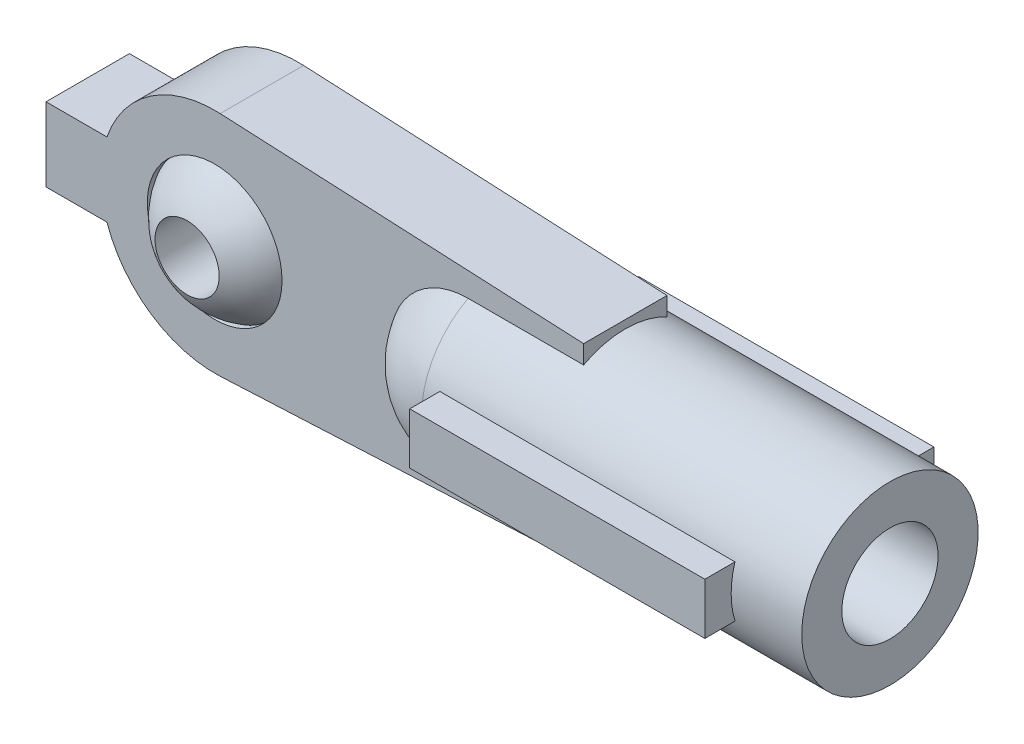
ISO-10303-21;
HEADER;
FILE_DESCRIPTION(('STEP AP214'),'2;1');
FILE_NAME('part.step','',(''),(''),'','','');
FILE_SCHEMA(('AUTOMOTIVE_DESIGN { 1 0 10303 214 1 1 1 1 }'));
ENDSEC;
DATA;
#1=APPLICATION_CONTEXT('core data for automotive mechanical design processes');
#2=APPLICATION_PROTOCOL_DEFINITION('international standard','automotive_design',2000,#1);
#3=PRODUCT_CONTEXT('',#1,'mechanical');
#4=PRODUCT('Part','Part','',(#3));
#5=PRODUCT_RELATED_PRODUCT_CATEGORY('part','',(#4));
#6=PRODUCT_DEFINITION_FORMATION('','',#4);
#7=PRODUCT_DEFINITION_CONTEXT('part definition',#1,'design');
#8=PRODUCT_DEFINITION('design','',#6,#7);
#9=PRODUCT_DEFINITION_SHAPE('','',#8);
#10=(LENGTH_UNIT() NAMED_UNIT(*) SI_UNIT(.MILLI.,.METRE.));
#11=(NAMED_UNIT(*) PLANE_ANGLE_UNIT() SI_UNIT($,.RADIAN.));
#12=(NAMED_UNIT(*) SI_UNIT($,.STERADIAN.) SOLID_ANGLE_UNIT());
#13=UNCERTAINTY_MEASURE_WITH_UNIT(LENGTH_MEASURE(1.E-05),#10,'distance_accuracy_value','');
#14=(GEOMETRIC_REPRESENTATION_CONTEXT(3) GLOBAL_UNCERTAINTY_ASSIGNED_CONTEXT((#13)) GLOBAL_UNIT_ASSIGNED_CONTEXT((#10,
#11,#12)) REPRESENTATION_CONTEXT('',''));
#15=CARTESIAN_POINT('',(0.,0.,0.));
#16=DIRECTION('',(0.,0.,1.));
#17=DIRECTION('',(1.,0.,0.));
#18=AXIS2_PLACEMENT_3D('',#15,#16,#17);
#19=CARTESIAN_POINT('',(0.,0.,0.));
#20=DIRECTION('',(0.,-1.,0.));
#21=DIRECTION('',(-1.,0.,0.));
#22=AXIS2_PLACEMENT_3D('',#19,#20,#21);
#23=SPHERICAL_SURFACE('',#22,2.38);
#24=CARTESIAN_POINT('',(0.,0.,0.));
#25=DIRECTION('',(0.,0.,1.));
#26=DIRECTION('',(1.,0.,0.));
#27=AXIS2_PLACEMENT_3D('',#24,#25,#26);
#28=SPHERICAL_SURFACE('',#27,2.38);
#29=CARTESIAN_POINT('',(0.,0.,-2.1597222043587));
#30=DIRECTION('',(0.,0.,1.));
#31=DIRECTION('',(1.,0.,0.));
#32=AXIS2_PLACEMENT_3D('',#29,#30,#31);
#33=CIRCLE('',#32,1.);
#34=CARTESIAN_POINT('',(1.,0.,-2.1597222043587));
#35=VERTEX_POINT('',#34);
#36=EDGE_CURVE('E11',#35,#35,#33,.F.);
#37=ORIENTED_EDGE('',*,*,#36,.F.);
#38=EDGE_LOOP('',(#37));
#39=FACE_BOUND('',#38,.T.);
#40=CARTESIAN_POINT('',(0.,0.,2.1597222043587));
#41=DIRECTION('',(0.,0.,-1.));
#42=DIRECTION('',(-1.,0.,0.));
#43=AXIS2_PLACEMENT_3D('',#40,#41,#42);
#44=CIRCLE('',#43,1.);
#45=CARTESIAN_POINT('',(-1.,0.,2.1597222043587));
#46=VERTEX_POINT('',#45);
#47=EDGE_CURVE('E56',#46,#46,#44,.F.);
#48=ORIENTED_EDGE('',*,*,#47,.F.);
#49=EDGE_LOOP('',(#48));
#50=FACE_BOUND('',#49,.T.);
#51=ADVANCED_FACE('F50',(#39,#50),#28,.T.);
#52=CARTESIAN_POINT('',(0.,0.,2.75));
#53=DIRECTION('',(0.,0.,-1.));
#54=DIRECTION('',(-1.,0.,0.));
#55=AXIS2_PLACEMENT_3D('',#52,#53,#54);
#56=CYLINDRICAL_SURFACE('',#55,1.);
#57=ORIENTED_EDGE('',*,*,#36,.T.);
#58=EDGE_LOOP('',(#57));
#59=FACE_BOUND('',#58,.T.);
#60=ORIENTED_EDGE('',*,*,#47,.T.);
#61=EDGE_LOOP('',(#60));
#62=FACE_BOUND('',#61,.T.);
#63=ADVANCED_FACE('F62',(#59,#62),#56,.F.);
#64=CLOSED_SHELL('',(#51,#63));
#65=MANIFOLD_SOLID_BREP('B2',#64);
#66=CARTESIAN_POINT('',(0.,0.,0.));
#67=DIRECTION('',(-1.,0.,0.));
#68=DIRECTION('',(0.,0.,1.));
#69=AXIS2_PLACEMENT_3D('',#66,#67,#68);
#70=CYLINDRICAL_SURFACE('',#69,2.75);
#71=CARTESIAN_POINT('',(8.35,0.,0.));
#72=DIRECTION('',(-1.,0.,0.));
#73=DIRECTION('',(0.,0.,-1.));
#74=AXIS2_PLACEMENT_3D('',#71,#72,#73);
#75=CIRCLE('',#74,2.75);
#76=CARTESIAN_POINT('',(8.35,-0.8,2.63106442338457));
#77=VERTEX_POINT('',#76);
#78=CARTESIAN_POINT('',(8.35,0.8,2.63106442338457));
#79=VERTEX_POINT('',#78);
#80=EDGE_CURVE('E272',#77,#79,#75,.T.);
#81=ORIENTED_EDGE('',*,*,#80,.T.);
#82=DIRECTION('',(1.,0.,0.));
#83=VECTOR('',#82,1.);
#84=CARTESIAN_POINT('',(8.35,0.8,2.63106442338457));
#85=LINE('',#84,#83);
#86=CARTESIAN_POINT('',(17.55,0.8,2.63106442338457));
#87=VERTEX_POINT('',#86);
#88=EDGE_CURVE('E288',#79,#87,#85,.T.);
#89=ORIENTED_EDGE('',*,*,#88,.T.);
#90=CARTESIAN_POINT('',(17.55,0.,0.));
#91=DIRECTION('',(-1.,0.,0.));
#92=DIRECTION('',(0.,0.,-1.));
#93=AXIS2_PLACEMENT_3D('',#90,#91,#92);
#94=CIRCLE('',#93,2.75);
#95=CARTESIAN_POINT('',(17.55,-0.8,2.63106442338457));
#96=VERTEX_POINT('',#95);
#97=EDGE_CURVE('E281',#96,#87,#94,.T.);
#98=ORIENTED_EDGE('',*,*,#97,.F.);
#99=DIRECTION('',(1.,0.,0.));
#100=VECTOR('',#99,1.);
#101=CARTESIAN_POINT('',(8.35,-0.8,2.63106442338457));
#102=LINE('',#101,#100);
#103=EDGE_CURVE('E291',#77,#96,#102,.T.);
#104=ORIENTED_EDGE('',*,*,#103,.F.);
#105=EDGE_LOOP('',(#81,#89,#98,#104));
#106=FACE_BOUND('',#105,.T.);
#107=DIRECTION('',(-1.,0.,0.));
#108=VECTOR('',#107,1.);
#109=CARTESIAN_POINT('',(0.,-2.42332416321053,1.3));
#110=LINE('',#109,#108);
#111=CARTESIAN_POINT('',(11.5,-2.42332416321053,1.3));
#112=VERTEX_POINT('',#111);
#113=CARTESIAN_POINT('',(7.9,-2.42332416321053,1.3));
#114=VERTEX_POINT('',#113);
#115=EDGE_CURVE('E315',#112,#114,#110,.T.);
#116=ORIENTED_EDGE('',*,*,#115,.F.);
#117=CARTESIAN_POINT('',(11.5,0.,0.));
#118=DIRECTION('',(-1.,0.,0.));
#119=DIRECTION('',(0.,0.,1.));
#120=AXIS2_PLACEMENT_3D('',#117,#118,#119);
#121=CIRCLE('',#120,2.75);
#122=CARTESIAN_POINT('',(11.5,-2.42332416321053,-1.3));
#123=VERTEX_POINT('',#122);
#124=EDGE_CURVE('E95',#112,#123,#121,.F.);
#125=ORIENTED_EDGE('',*,*,#124,.T.);
#126=DIRECTION('',(-1.,0.,0.));
#127=VECTOR('',#126,1.);
#128=CARTESIAN_POINT('',(0.,-2.42332416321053,-1.3));
#129=LINE('',#128,#127);
#130=CARTESIAN_POINT('',(7.9,-2.42332416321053,-1.3));
#131=VERTEX_POINT('',#130);
#132=EDGE_CURVE('E312',#123,#131,#129,.T.);
#133=ORIENTED_EDGE('',*,*,#132,.T.);
#134=CARTESIAN_POINT('',(7.9,0.,0.));
#135=DIRECTION('',(-1.,0.,0.));
#136=DIRECTION('',(0.,0.,1.));
#137=AXIS2_PLACEMENT_3D('',#134,#135,#136);
#138=CIRCLE('',#137,2.75);
#139=CARTESIAN_POINT('',(7.9,2.42332416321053,-1.3));
#140=VERTEX_POINT('',#139);
#141=EDGE_CURVE('E302',#140,#131,#138,.T.);
#142=ORIENTED_EDGE('',*,*,#141,.F.);
#143=DIRECTION('',(-1.,0.,0.));
#144=VECTOR('',#143,1.);
#145=CARTESIAN_POINT('',(0.,2.42332416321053,-1.3));
#146=LINE('',#145,#144);
#147=CARTESIAN_POINT('',(11.5,2.42332416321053,-1.3));
#148=VERTEX_POINT('',#147);
#149=EDGE_CURVE('E306',#140,#148,#146,.F.);
#150=ORIENTED_EDGE('',*,*,#149,.T.);
#151=CARTESIAN_POINT('',(11.5,2.42332416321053,1.3));
#152=VERTEX_POINT('',#151);
#153=EDGE_CURVE('E386',#148,#152,#121,.F.);
#154=ORIENTED_EDGE('',*,*,#153,.T.);
#155=DIRECTION('',(-1.,0.,0.));
#156=VECTOR('',#155,1.);
#157=CARTESIAN_POINT('',(0.,2.42332416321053,1.3));
#158=LINE('',#157,#156);
#159=CARTESIAN_POINT('',(7.9,2.42332416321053,1.3));
#160=VERTEX_POINT('',#159);
#161=EDGE_CURVE('E309',#160,#152,#158,.F.);
#162=ORIENTED_EDGE('',*,*,#161,.F.);
#163=EDGE_CURVE('E297',#114,#160,#138,.T.);
#164=ORIENTED_EDGE('',*,*,#163,.F.);
#165=EDGE_LOOP('',(#116,#125,#133,#142,#150,#154,#162,#164));
#166=FACE_BOUND('',#165,.T.);
#167=CARTESIAN_POINT('',(19.75,0.,0.));
#168=DIRECTION('',(-1.,0.,0.));
#169=DIRECTION('',(0.,0.,1.));
#170=AXIS2_PLACEMENT_3D('',#167,#168,#169);
#171=CIRCLE('',#170,2.75);
#172=CARTESIAN_POINT('',(19.75,0.,2.75));
#173=VERTEX_POINT('',#172);
#174=EDGE_CURVE('E303',#173,#173,#171,.T.);
#175=ORIENTED_EDGE('',*,*,#174,.T.);
#176=EDGE_LOOP('',(#175));
#177=FACE_BOUND('',#176,.T.);
#178=CARTESIAN_POINT('',(8.35,0.,0.));
#179=DIRECTION('',(-1.,0.,0.));
#180=DIRECTION('',(0.,0.,-1.));
#181=AXIS2_PLACEMENT_3D('',#178,#179,#180);
#182=CIRCLE('',#181,2.75);
#183=CARTESIAN_POINT('',(8.35,0.8,-2.63106442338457));
#184=VERTEX_POINT('',#183);
#185=CARTESIAN_POINT('',(8.35,-0.8,-2.63106442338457));
#186=VERTEX_POINT('',#185);
#187=EDGE_CURVE('E243',#184,#186,#182,.T.);
#188=ORIENTED_EDGE('',*,*,#187,.T.);
#189=DIRECTION('',(1.,0.,0.));
#190=VECTOR('',#189,1.);
#191=CARTESIAN_POINT('',(8.35,-0.8,-2.63106442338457));
#192=LINE('',#191,#190);
#193=CARTESIAN_POINT('',(17.55,-0.8,-2.63106442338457));
#194=VERTEX_POINT('',#193);
#195=EDGE_CURVE('E261',#186,#194,#192,.T.);
#196=ORIENTED_EDGE('',*,*,#195,.T.);
#197=CARTESIAN_POINT('',(17.55,0.,0.));
#198=DIRECTION('',(-1.,0.,0.));
#199=DIRECTION('',(0.,0.,-1.));
#200=AXIS2_PLACEMENT_3D('',#197,#198,#199);
#201=CIRCLE('',#200,2.75);
#202=CARTESIAN_POINT('',(17.55,0.8,-2.63106442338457));
#203=VERTEX_POINT('',#202);
#204=EDGE_CURVE('E250',#203,#194,#201,.T.);
#205=ORIENTED_EDGE('',*,*,#204,.F.);
#206=DIRECTION('',(1.,0.,0.));
#207=VECTOR('',#206,1.);
#208=CARTESIAN_POINT('',(8.35,0.8,-2.63106442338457));
#209=LINE('',#208,#207);
#210=EDGE_CURVE('E233',#184,#203,#209,.T.);
#211=ORIENTED_EDGE('',*,*,#210,.F.);
#212=EDGE_LOOP('',(#188,#196,#205,#211));
#213=FACE_BOUND('',#212,.T.);
#214=ADVANCED_FACE('F87',(#106,#166,#177,#213),#70,.T.);
#215=CARTESIAN_POINT('',(0.,0.,1.3));
#216=DIRECTION('',(0.,0.,1.));
#217=DIRECTION('',(1.,0.,0.));
#218=AXIS2_PLACEMENT_3D('',#215,#216,#217);
#219=PLANE('',#218);
#220=CARTESIAN_POINT('',(0.,0.,1.3));
#221=DIRECTION('',(0.,0.,1.));
#222=DIRECTION('',(1.,0.,0.));
#223=AXIS2_PLACEMENT_3D('',#220,#221,#222);
#224=CIRCLE('',#223,2.1);
#225=CARTESIAN_POINT('',(2.1,0.,1.3));
#226=VERTEX_POINT('',#225);
#227=EDGE_CURVE('E320',#226,#226,#224,.T.);
#228=ORIENTED_EDGE('',*,*,#227,.F.);
#229=EDGE_LOOP('',(#228));
#230=FACE_BOUND('',#229,.T.);
#231=CARTESIAN_POINT('',(7.9,0.,1.3));
#232=DIRECTION('',(0.,0.,1.));
#233=DIRECTION('',(1.,0.,0.));
#234=AXIS2_PLACEMENT_3D('',#231,#232,#233);
#235=CIRCLE('',#234,2.42332416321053);
#236=EDGE_CURVE('E317',#114,#160,#235,.F.);
#237=ORIENTED_EDGE('',*,*,#236,.T.);
#238=ORIENTED_EDGE('',*,*,#161,.T.);
#239=DIRECTION('',(0.,1.,0.));
#240=VECTOR('',#239,1.);
#241=CARTESIAN_POINT('',(11.5,-3.,1.3));
#242=LINE('',#241,#240);
#243=CARTESIAN_POINT('',(11.5,3.,1.3));
#244=VERTEX_POINT('',#243);
#245=EDGE_CURVE('E340',#152,#244,#242,.T.);
#246=ORIENTED_EDGE('',*,*,#245,.T.);
#247=DIRECTION('',(-0.998841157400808,0.0481283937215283,0.));
#248=VECTOR('',#247,1.);
#249=CARTESIAN_POINT('',(11.5,3.,1.3));
#250=LINE('',#249,#248);
#251=CARTESIAN_POINT('',(0.170855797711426,3.54588610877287,1.3));
#252=VERTEX_POINT('',#251);
#253=EDGE_CURVE('E344',#244,#252,#250,.T.);
#254=ORIENTED_EDGE('',*,*,#253,.T.);
#255=CARTESIAN_POINT('',(0.,0.,1.3));
#256=DIRECTION('',(0.,0.,1.));
#257=DIRECTION('',(1.,0.,0.));
#258=AXIS2_PLACEMENT_3D('',#255,#256,#257);
#259=CIRCLE('',#258,3.55);
#260=CARTESIAN_POINT('',(-3.35857112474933,1.15,1.3));
#261=VERTEX_POINT('',#260);
#262=EDGE_CURVE('E326',#252,#261,#259,.T.);
#263=ORIENTED_EDGE('',*,*,#262,.T.);
#264=DIRECTION('',(-1.,0.,0.));
#265=VECTOR('',#264,1.);
#266=CARTESIAN_POINT('',(-3.35857112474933,1.15,1.3));
#267=LINE('',#266,#265);
#268=CARTESIAN_POINT('',(-5.25857112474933,1.15,1.3));
#269=VERTEX_POINT('',#268);
#270=EDGE_CURVE('E329',#261,#269,#267,.T.);
#271=ORIENTED_EDGE('',*,*,#270,.T.);
#272=DIRECTION('',(0.,-1.,0.));
#273=VECTOR('',#272,1.);
#274=CARTESIAN_POINT('',(-5.25857112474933,1.15,1.3));
#275=LINE('',#274,#273);
#276=CARTESIAN_POINT('',(-5.25857112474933,-1.15,1.3));
#277=VERTEX_POINT('',#276);
#278=EDGE_CURVE('E332',#269,#277,#275,.T.);
#279=ORIENTED_EDGE('',*,*,#278,.T.);
#280=DIRECTION('',(1.,0.,0.));
#281=VECTOR('',#280,1.);
#282=CARTESIAN_POINT('',(-5.25857112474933,-1.15,1.3));
#283=LINE('',#282,#281);
#284=CARTESIAN_POINT('',(-3.35857112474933,-1.15,1.3));
#285=VERTEX_POINT('',#284);
#286=EDGE_CURVE('E334',#277,#285,#283,.T.);
#287=ORIENTED_EDGE('',*,*,#286,.T.);
#288=CARTESIAN_POINT('',(0.,0.,1.3));
#289=DIRECTION('',(0.,0.,1.));
#290=DIRECTION('',(1.,0.,0.));
#291=AXIS2_PLACEMENT_3D('',#288,#289,#290);
#292=CIRCLE('',#291,3.55);
#293=CARTESIAN_POINT('',(0.170855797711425,-3.54588610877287,1.3));
#294=VERTEX_POINT('',#293);
#295=EDGE_CURVE('E336',#285,#294,#292,.T.);
#296=ORIENTED_EDGE('',*,*,#295,.T.);
#297=DIRECTION('',(0.998841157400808,0.0481283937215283,0.));
#298=VECTOR('',#297,1.);
#299=CARTESIAN_POINT('',(11.5,-3.,1.3));
#300=LINE('',#299,#298);
#301=CARTESIAN_POINT('',(11.5,-3.,1.3));
#302=VERTEX_POINT('',#301);
#303=EDGE_CURVE('E338',#294,#302,#300,.T.);
#304=ORIENTED_EDGE('',*,*,#303,.T.);
#305=EDGE_CURVE('E341',#302,#112,#242,.T.);
#306=ORIENTED_EDGE('',*,*,#305,.T.);
#307=ORIENTED_EDGE('',*,*,#115,.T.);
#308=EDGE_LOOP('',(#237,#238,#246,#254,#263,#271,#279,#287,#296,#304,#306,#307));
#309=FACE_BOUND('',#308,.T.);
#310=ADVANCED_FACE('F401',(#230,#309),#219,.T.);
#311=CARTESIAN_POINT('',(0.,0.,-1.3));
#312=DIRECTION('',(0.,0.,1.));
#313=DIRECTION('',(1.,0.,0.));
#314=AXIS2_PLACEMENT_3D('',#311,#312,#313);
#315=PLANE('',#314);
#316=CARTESIAN_POINT('',(0.,0.,-1.3));
#317=DIRECTION('',(0.,0.,1.));
#318=DIRECTION('',(1.,0.,0.));
#319=AXIS2_PLACEMENT_3D('',#316,#317,#318);
#320=CIRCLE('',#319,2.1);
#321=CARTESIAN_POINT('',(2.1,0.,-1.3));
#322=VERTEX_POINT('',#321);
#323=EDGE_CURVE('E319',#322,#322,#320,.T.);
#324=ORIENTED_EDGE('',*,*,#323,.T.);
#325=EDGE_LOOP('',(#324));
#326=FACE_BOUND('',#325,.T.);
#327=ORIENTED_EDGE('',*,*,#149,.F.);
#328=CARTESIAN_POINT('',(7.9,0.,-1.3));
#329=DIRECTION('',(0.,0.,1.));
#330=DIRECTION('',(1.,0.,0.));
#331=AXIS2_PLACEMENT_3D('',#328,#329,#330);
#332=CIRCLE('',#331,2.42332416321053);
#333=EDGE_CURVE('E48',#131,#140,#332,.F.);
#334=ORIENTED_EDGE('',*,*,#333,.F.);
#335=ORIENTED_EDGE('',*,*,#132,.F.);
#336=DIRECTION('',(0.,1.,0.));
#337=VECTOR('',#336,1.);
#338=CARTESIAN_POINT('',(11.5,-3.,-1.3));
#339=LINE('',#338,#337);
#340=CARTESIAN_POINT('',(11.5,-3.,-1.3));
#341=VERTEX_POINT('',#340);
#342=EDGE_CURVE('E360',#341,#123,#339,.T.);
#343=ORIENTED_EDGE('',*,*,#342,.F.);
#344=DIRECTION('',(0.998841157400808,0.0481283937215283,0.));
#345=VECTOR('',#344,1.);
#346=CARTESIAN_POINT('',(11.5,-3.,-1.3));
#347=LINE('',#346,#345);
#348=CARTESIAN_POINT('',(0.170855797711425,-3.54588610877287,-1.3));
#349=VERTEX_POINT('',#348);
#350=EDGE_CURVE('E357',#349,#341,#347,.T.);
#351=ORIENTED_EDGE('',*,*,#350,.F.);
#352=CARTESIAN_POINT('',(0.,0.,-1.3));
#353=DIRECTION('',(0.,0.,1.));
#354=DIRECTION('',(1.,0.,0.));
#355=AXIS2_PLACEMENT_3D('',#352,#353,#354);
#356=CIRCLE('',#355,3.55);
#357=CARTESIAN_POINT('',(-3.35857112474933,-1.15,-1.3));
#358=VERTEX_POINT('',#357);
#359=EDGE_CURVE('E355',#358,#349,#356,.T.);
#360=ORIENTED_EDGE('',*,*,#359,.F.);
#361=DIRECTION('',(1.,0.,0.));
#362=VECTOR('',#361,1.);
#363=CARTESIAN_POINT('',(-5.25857112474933,-1.15,-1.3));
#364=LINE('',#363,#362);
#365=CARTESIAN_POINT('',(-5.25857112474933,-1.15,-1.3));
#366=VERTEX_POINT('',#365);
#367=EDGE_CURVE('E353',#366,#358,#364,.T.);
#368=ORIENTED_EDGE('',*,*,#367,.F.);
#369=DIRECTION('',(0.,-1.,0.));
#370=VECTOR('',#369,1.);
#371=CARTESIAN_POINT('',(-5.25857112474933,1.15,-1.3));
#372=LINE('',#371,#370);
#373=CARTESIAN_POINT('',(-5.25857112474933,1.15,-1.3));
#374=VERTEX_POINT('',#373);
#375=EDGE_CURVE('E351',#374,#366,#372,.T.);
#376=ORIENTED_EDGE('',*,*,#375,.F.);
#377=DIRECTION('',(-1.,0.,0.));
#378=VECTOR('',#377,1.);
#379=CARTESIAN_POINT('',(-3.35857112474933,1.15,-1.3));
#380=LINE('',#379,#378);
#381=CARTESIAN_POINT('',(-3.35857112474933,1.15,-1.3));
#382=VERTEX_POINT('',#381);
#383=EDGE_CURVE('E349',#382,#374,#380,.T.);
#384=ORIENTED_EDGE('',*,*,#383,.F.);
#385=CARTESIAN_POINT('',(0.,0.,-1.3));
#386=DIRECTION('',(0.,0.,1.));
#387=DIRECTION('',(1.,0.,0.));
#388=AXIS2_PLACEMENT_3D('',#385,#386,#387);
#389=CIRCLE('',#388,3.55);
#390=CARTESIAN_POINT('',(0.170855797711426,3.54588610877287,-1.3));
#391=VERTEX_POINT('',#390);
#392=EDGE_CURVE('E323',#391,#382,#389,.T.);
#393=ORIENTED_EDGE('',*,*,#392,.F.);
#394=DIRECTION('',(-0.998841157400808,0.0481283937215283,0.));
#395=VECTOR('',#394,1.);
#396=CARTESIAN_POINT('',(11.5,3.,-1.3));
#397=LINE('',#396,#395);
#398=CARTESIAN_POINT('',(11.5,3.,-1.3));
#399=VERTEX_POINT('',#398);
#400=EDGE_CURVE('E330',#399,#391,#397,.T.);
#401=ORIENTED_EDGE('',*,*,#400,.F.);
#402=EDGE_CURVE('E359',#148,#399,#339,.T.);
#403=ORIENTED_EDGE('',*,*,#402,.F.);
#404=EDGE_LOOP('',(#327,#334,#335,#343,#351,#360,#368,#376,#384,#393,#401,#403));
#405=FACE_BOUND('',#404,.T.);
#406=ADVANCED_FACE('F411',(#326,#405),#315,.F.);
#407=CARTESIAN_POINT('',(11.5,-3.,1.3));
#408=DIRECTION('',(-1.,0.,0.));
#409=DIRECTION('',(0.,0.,1.));
#410=AXIS2_PLACEMENT_3D('',#407,#408,#409);
#411=PLANE('',#410);
#412=ORIENTED_EDGE('',*,*,#124,.F.);
#413=ORIENTED_EDGE('',*,*,#305,.F.);
#414=DIRECTION('',(0.,0.,-1.));
#415=VECTOR('',#414,1.);
#416=CARTESIAN_POINT('',(11.5,-3.,1.3));
#417=LINE('',#416,#415);
#418=EDGE_CURVE('E369',#302,#341,#417,.T.);
#419=ORIENTED_EDGE('',*,*,#418,.T.);
#420=ORIENTED_EDGE('',*,*,#342,.T.);
#421=EDGE_LOOP('',(#412,#413,#419,#420));
#422=FACE_BOUND('',#421,.T.);
#423=ADVANCED_FACE('F398',(#422),#411,.F.);
#424=ORIENTED_EDGE('',*,*,#153,.F.);
#425=ORIENTED_EDGE('',*,*,#402,.T.);
#426=DIRECTION('',(0.,0.,-1.));
#427=VECTOR('',#426,1.);
#428=CARTESIAN_POINT('',(11.5,3.,1.3));
#429=LINE('',#428,#427);
#430=EDGE_CURVE('E366',#244,#399,#429,.T.);
#431=ORIENTED_EDGE('',*,*,#430,.F.);
#432=ORIENTED_EDGE('',*,*,#245,.F.);
#433=EDGE_LOOP('',(#424,#425,#431,#432));
#434=FACE_BOUND('',#433,.T.);
#435=ADVANCED_FACE('F451',(#434),#411,.F.);
#436=CARTESIAN_POINT('',(0.,0.,1.3));
#437=DIRECTION('',(0.,0.,-1.));
#438=DIRECTION('',(-1.,0.,0.));
#439=AXIS2_PLACEMENT_3D('',#436,#437,#438);
#440=CYLINDRICAL_SURFACE('',#439,3.55);
#441=ORIENTED_EDGE('',*,*,#392,.T.);
#442=DIRECTION('',(0.,0.,-1.));
#443=VECTOR('',#442,1.);
#444=CARTESIAN_POINT('',(-3.35857112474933,1.15,1.3));
#445=LINE('',#444,#443);
#446=EDGE_CURVE('E384',#261,#382,#445,.T.);
#447=ORIENTED_EDGE('',*,*,#446,.F.);
#448=ORIENTED_EDGE('',*,*,#262,.F.);
#449=DIRECTION('',(0.,0.,-1.));
#450=VECTOR('',#449,1.);
#451=CARTESIAN_POINT('',(0.170855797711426,3.54588610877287,1.3));
#452=LINE('',#451,#450);
#453=EDGE_CURVE('E346',#252,#391,#452,.T.);
#454=ORIENTED_EDGE('',*,*,#453,.T.);
#455=EDGE_LOOP('',(#441,#447,#448,#454));
#456=FACE_BOUND('',#455,.T.);
#457=ADVANCED_FACE('F89',(#456),#440,.T.);
#458=CARTESIAN_POINT('',(-3.35857112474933,1.15,1.3));
#459=DIRECTION('',(0.,-1.,0.));
#460=DIRECTION('',(1.,0.,0.));
#461=AXIS2_PLACEMENT_3D('',#458,#459,#460);
#462=PLANE('',#461);
#463=ORIENTED_EDGE('',*,*,#383,.T.);
#464=DIRECTION('',(0.,0.,-1.));
#465=VECTOR('',#464,1.);
#466=CARTESIAN_POINT('',(-5.25857112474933,1.15,1.3));
#467=LINE('',#466,#465);
#468=EDGE_CURVE('E381',#269,#374,#467,.T.);
#469=ORIENTED_EDGE('',*,*,#468,.F.);
#470=ORIENTED_EDGE('',*,*,#270,.F.);
#471=ORIENTED_EDGE('',*,*,#446,.T.);
#472=EDGE_LOOP('',(#463,#469,#470,#471));
#473=FACE_BOUND('',#472,.T.);
#474=ADVANCED_FACE('F464',(#473),#462,.F.);
#475=CARTESIAN_POINT('',(-5.25857112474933,1.15,1.3));
#476=DIRECTION('',(1.,0.,0.));
#477=DIRECTION('',(0.,0.,-1.));
#478=AXIS2_PLACEMENT_3D('',#475,#476,#477);
#479=PLANE('',#478);
#480=ORIENTED_EDGE('',*,*,#375,.T.);
#481=DIRECTION('',(0.,0.,-1.));
#482=VECTOR('',#481,1.);
#483=CARTESIAN_POINT('',(-5.25857112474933,-1.15,1.3));
#484=LINE('',#483,#482);
#485=EDGE_CURVE('E378',#277,#366,#484,.T.);
#486=ORIENTED_EDGE('',*,*,#485,.F.);
#487=ORIENTED_EDGE('',*,*,#278,.F.);
#488=ORIENTED_EDGE('',*,*,#468,.T.);
#489=EDGE_LOOP('',(#480,#486,#487,#488));
#490=FACE_BOUND('',#489,.T.);
#491=ADVANCED_FACE('F461',(#490),#479,.F.);
#492=CARTESIAN_POINT('',(-5.25857112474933,-1.15,1.3));
#493=DIRECTION('',(0.,1.,0.));
#494=DIRECTION('',(-1.,0.,0.));
#495=AXIS2_PLACEMENT_3D('',#492,#493,#494);
#496=PLANE('',#495);
#497=ORIENTED_EDGE('',*,*,#367,.T.);
#498=DIRECTION('',(0.,0.,-1.));
#499=VECTOR('',#498,1.);
#500=CARTESIAN_POINT('',(-3.35857112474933,-1.15,1.3));
#501=LINE('',#500,#499);
#502=EDGE_CURVE('E375',#285,#358,#501,.T.);
#503=ORIENTED_EDGE('',*,*,#502,.F.);
#504=ORIENTED_EDGE('',*,*,#286,.F.);
#505=ORIENTED_EDGE('',*,*,#485,.T.);
#506=EDGE_LOOP('',(#497,#503,#504,#505));
#507=FACE_BOUND('',#506,.T.);
#508=ADVANCED_FACE('F457',(#507),#496,.F.);
#509=CARTESIAN_POINT('',(0.,0.,1.3));
#510=DIRECTION('',(0.,0.,-1.));
#511=DIRECTION('',(-1.,0.,0.));
#512=AXIS2_PLACEMENT_3D('',#509,#510,#511);
#513=CYLINDRICAL_SURFACE('',#512,3.55);
#514=ORIENTED_EDGE('',*,*,#359,.T.);
#515=DIRECTION('',(0.,0.,-1.));
#516=VECTOR('',#515,1.);
#517=CARTESIAN_POINT('',(0.170855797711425,-3.54588610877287,1.3));
#518=LINE('',#517,#516);
#519=EDGE_CURVE('E372',#294,#349,#518,.T.);
#520=ORIENTED_EDGE('',*,*,#519,.F.);
#521=ORIENTED_EDGE('',*,*,#295,.F.);
#522=ORIENTED_EDGE('',*,*,#502,.T.);
#523=EDGE_LOOP('',(#514,#520,#521,#522));
#524=FACE_BOUND('',#523,.T.);
#525=ADVANCED_FACE('F454',(#524),#513,.T.);
#526=CARTESIAN_POINT('',(11.5,-3.,1.3));
#527=DIRECTION('',(-0.0481283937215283,0.998841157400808,0.));
#528=DIRECTION('',(-0.998841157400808,-0.0481283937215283,0.));
#529=AXIS2_PLACEMENT_3D('',#526,#527,#528);
#530=PLANE('',#529);
#531=ORIENTED_EDGE('',*,*,#350,.T.);
#532=ORIENTED_EDGE('',*,*,#418,.F.);
#533=ORIENTED_EDGE('',*,*,#303,.F.);
#534=ORIENTED_EDGE('',*,*,#519,.T.);
#535=EDGE_LOOP('',(#531,#532,#533,#534));
#536=FACE_BOUND('',#535,.T.);
#537=ADVANCED_FACE('F408',(#536),#530,.F.);
#538=CARTESIAN_POINT('',(11.5,3.,1.3));
#539=DIRECTION('',(-0.0481283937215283,-0.998841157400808,0.));
#540=DIRECTION('',(0.998841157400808,-0.0481283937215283,0.));
#541=AXIS2_PLACEMENT_3D('',#538,#539,#540);
#542=PLANE('',#541);
#543=ORIENTED_EDGE('',*,*,#400,.T.);
#544=ORIENTED_EDGE('',*,*,#453,.F.);
#545=ORIENTED_EDGE('',*,*,#253,.F.);
#546=ORIENTED_EDGE('',*,*,#430,.T.);
#547=EDGE_LOOP('',(#543,#544,#545,#546));
#548=FACE_BOUND('',#547,.T.);
#549=ADVANCED_FACE('F427',(#548),#542,.F.);
#550=CARTESIAN_POINT('',(0.,0.,1.3));
#551=DIRECTION('',(0.,0.,-1.));
#552=DIRECTION('',(-1.,0.,0.));
#553=AXIS2_PLACEMENT_3D('',#550,#551,#552);
#554=CYLINDRICAL_SURFACE('',#553,2.1);
#555=ORIENTED_EDGE('',*,*,#227,.T.);
#556=EDGE_LOOP('',(#555));
#557=FACE_BOUND('',#556,.T.);
#558=ORIENTED_EDGE('',*,*,#323,.F.);
#559=EDGE_LOOP('',(#558));
#560=FACE_BOUND('',#559,.T.);
#561=ADVANCED_FACE('F418',(#557,#560),#554,.F.);
#562=CARTESIAN_POINT('',(7.9,0.,0.));
#563=DIRECTION('',(-1.,0.,0.));
#564=DIRECTION('',(0.,1.,0.));
#565=AXIS2_PLACEMENT_3D('',#562,#563,#564);
#566=SPHERICAL_SURFACE('',#565,2.75);
#567=ORIENTED_EDGE('',*,*,#141,.T.);
#568=ORIENTED_EDGE('',*,*,#333,.T.);
#569=EDGE_LOOP('',(#567,#568));
#570=FACE_BOUND('',#569,.T.);
#571=ADVANCED_FACE('F415',(#570),#566,.T.);
#572=CARTESIAN_POINT('',(19.75,2.75,0.));
#573=DIRECTION('',(-1.,0.,0.));
#574=DIRECTION('',(0.,0.,1.));
#575=AXIS2_PLACEMENT_3D('',#572,#573,#574);
#576=PLANE('',#575);
#577=CARTESIAN_POINT('',(19.75,0.,0.));
#578=DIRECTION('',(1.,0.,0.));
#579=DIRECTION('',(0.,0.,-1.));
#580=AXIS2_PLACEMENT_3D('',#577,#578,#579);
#581=CIRCLE('',#580,1.5);
#582=CARTESIAN_POINT('',(19.75,0.,-1.5));
#583=VERTEX_POINT('',#582);
#584=EDGE_CURVE('E287',#583,#583,#581,.T.);
#585=ORIENTED_EDGE('',*,*,#584,.F.);
#586=EDGE_LOOP('',(#585));
#587=FACE_BOUND('',#586,.T.);
#588=ORIENTED_EDGE('',*,*,#174,.F.);
#589=EDGE_LOOP('',(#588));
#590=FACE_BOUND('',#589,.T.);
#591=ADVANCED_FACE('F417',(#587,#590),#576,.F.);
#592=ORIENTED_EDGE('',*,*,#236,.F.);
#593=ORIENTED_EDGE('',*,*,#163,.T.);
#594=EDGE_LOOP('',(#592,#593));
#595=FACE_BOUND('',#594,.T.);
#596=ADVANCED_FACE('F420',(#595),#566,.T.);
#597=CARTESIAN_POINT('',(8.25,0.,0.));
#598=DIRECTION('',(1.,0.,0.));
#599=DIRECTION('',(0.,0.,-1.));
#600=AXIS2_PLACEMENT_3D('',#597,#598,#599);
#601=CYLINDRICAL_SURFACE('',#600,1.5);
#602=CARTESIAN_POINT('',(8.25,0.,0.));
#603=DIRECTION('',(1.,0.,0.));
#604=DIRECTION('',(0.,0.,-1.));
#605=AXIS2_PLACEMENT_3D('',#602,#603,#604);
#606=CIRCLE('',#605,1.5);
#607=CARTESIAN_POINT('',(8.25,0.,-1.5));
#608=VERTEX_POINT('',#607);
#609=EDGE_CURVE('E294',#608,#608,#606,.T.);
#610=ORIENTED_EDGE('',*,*,#609,.F.);
#611=EDGE_LOOP('',(#610));
#612=FACE_BOUND('',#611,.T.);
#613=ORIENTED_EDGE('',*,*,#584,.T.);
#614=EDGE_LOOP('',(#613));
#615=FACE_BOUND('',#614,.T.);
#616=ADVANCED_FACE('F433',(#612,#615),#601,.F.);
#617=CARTESIAN_POINT('',(8.25,0.,0.));
#618=DIRECTION('',(1.,0.,0.));
#619=DIRECTION('',(0.,0.,-1.));
#620=AXIS2_PLACEMENT_3D('',#617,#618,#619);
#621=PLANE('',#620);
#622=ORIENTED_EDGE('',*,*,#609,.T.);
#623=EDGE_LOOP('',(#622));
#624=FACE_BOUND('',#623,.T.);
#625=ADVANCED_FACE('F578',(#624),#621,.T.);
#626=CARTESIAN_POINT('',(8.35,0.8,3.57));
#627=DIRECTION('',(0.,0.,1.));
#628=DIRECTION('',(0.,-1.,0.));
#629=AXIS2_PLACEMENT_3D('',#626,#627,#628);
#630=PLANE('',#629);
#631=DIRECTION('',(0.,-1.,0.));
#632=VECTOR('',#631,1.);
#633=CARTESIAN_POINT('',(17.55,0.8,3.57));
#634=LINE('',#633,#632);
#635=CARTESIAN_POINT('',(17.55,0.8,3.57));
#636=VERTEX_POINT('',#635);
#637=CARTESIAN_POINT('',(17.55,-0.8,3.57));
#638=VERTEX_POINT('',#637);
#639=EDGE_CURVE('E260',#636,#638,#634,.T.);
#640=ORIENTED_EDGE('',*,*,#639,.F.);
#641=DIRECTION('',(1.,0.,0.));
#642=VECTOR('',#641,1.);
#643=CARTESIAN_POINT('',(8.35,0.8,3.57));
#644=LINE('',#643,#642);
#645=CARTESIAN_POINT('',(8.35,0.8,3.57));
#646=VERTEX_POINT('',#645);
#647=EDGE_CURVE('E285',#646,#636,#644,.T.);
#648=ORIENTED_EDGE('',*,*,#647,.F.);
#649=DIRECTION('',(0.,-1.,0.));
#650=VECTOR('',#649,1.);
#651=CARTESIAN_POINT('',(8.35,0.8,3.57));
#652=LINE('',#651,#650);
#653=CARTESIAN_POINT('',(8.35,-0.8,3.57));
#654=VERTEX_POINT('',#653);
#655=EDGE_CURVE('E265',#646,#654,#652,.T.);
#656=ORIENTED_EDGE('',*,*,#655,.T.);
#657=DIRECTION('',(1.,0.,0.));
#658=VECTOR('',#657,1.);
#659=CARTESIAN_POINT('',(8.35,-0.8,3.57));
#660=LINE('',#659,#658);
#661=EDGE_CURVE('E278',#654,#638,#660,.T.);
#662=ORIENTED_EDGE('',*,*,#661,.T.);
#663=EDGE_LOOP('',(#640,#648,#656,#662));
#664=FACE_BOUND('',#663,.T.);
#665=ADVANCED_FACE('F586',(#664),#630,.T.);
#666=CARTESIAN_POINT('',(8.35,0.8,3.57));
#667=DIRECTION('',(0.,1.,0.));
#668=DIRECTION('',(0.,0.,1.));
#669=AXIS2_PLACEMENT_3D('',#666,#667,#668);
#670=PLANE('',#669);
#671=DIRECTION('',(0.,0.,1.));
#672=VECTOR('',#671,1.);
#673=CARTESIAN_POINT('',(17.55,0.8,3.57));
#674=LINE('',#673,#672);
#675=EDGE_CURVE('E269',#87,#636,#674,.T.);
#676=ORIENTED_EDGE('',*,*,#675,.F.);
#677=ORIENTED_EDGE('',*,*,#88,.F.);
#678=DIRECTION('',(0.,0.,1.));
#679=VECTOR('',#678,1.);
#680=CARTESIAN_POINT('',(8.35,0.8,3.57));
#681=LINE('',#680,#679);
#682=EDGE_CURVE('E275',#79,#646,#681,.T.);
#683=ORIENTED_EDGE('',*,*,#682,.T.);
#684=ORIENTED_EDGE('',*,*,#647,.T.);
#685=EDGE_LOOP('',(#676,#677,#683,#684));
#686=FACE_BOUND('',#685,.T.);
#687=ADVANCED_FACE('F599',(#686),#670,.T.);
#688=CARTESIAN_POINT('',(8.35,-0.8,3.57));
#689=DIRECTION('',(0.,-1.,0.));
#690=DIRECTION('',(0.,0.,-1.));
#691=AXIS2_PLACEMENT_3D('',#688,#689,#690);
#692=PLANE('',#691);
#693=DIRECTION('',(0.,0.,-1.));
#694=VECTOR('',#693,1.);
#695=CARTESIAN_POINT('',(17.55,-0.8,3.57));
#696=LINE('',#695,#694);
#697=EDGE_CURVE('E110',#638,#96,#696,.T.);
#698=ORIENTED_EDGE('',*,*,#697,.F.);
#699=ORIENTED_EDGE('',*,*,#661,.F.);
#700=DIRECTION('',(0.,0.,-1.));
#701=VECTOR('',#700,1.);
#702=CARTESIAN_POINT('',(8.35,-0.8,3.57));
#703=LINE('',#702,#701);
#704=EDGE_CURVE('E268',#654,#77,#703,.T.);
#705=ORIENTED_EDGE('',*,*,#704,.T.);
#706=ORIENTED_EDGE('',*,*,#103,.T.);
#707=EDGE_LOOP('',(#698,#699,#705,#706));
#708=FACE_BOUND('',#707,.T.);
#709=ADVANCED_FACE('F608',(#708),#692,.T.);
#710=CARTESIAN_POINT('',(8.35,0.,0.));
#711=DIRECTION('',(1.,0.,0.));
#712=DIRECTION('',(0.,0.,-1.));
#713=AXIS2_PLACEMENT_3D('',#710,#711,#712);
#714=PLANE('',#713);
#715=ORIENTED_EDGE('',*,*,#655,.F.);
#716=ORIENTED_EDGE('',*,*,#682,.F.);
#717=ORIENTED_EDGE('',*,*,#80,.F.);
#718=ORIENTED_EDGE('',*,*,#704,.F.);
#719=EDGE_LOOP('',(#715,#716,#717,#718));
#720=FACE_BOUND('',#719,.T.);
#721=ADVANCED_FACE('F617',(#720),#714,.F.);
#722=CARTESIAN_POINT('',(17.55,0.,0.));
#723=DIRECTION('',(1.,0.,0.));
#724=DIRECTION('',(0.,0.,-1.));
#725=AXIS2_PLACEMENT_3D('',#722,#723,#724);
#726=PLANE('',#725);
#727=ORIENTED_EDGE('',*,*,#639,.T.);
#728=ORIENTED_EDGE('',*,*,#697,.T.);
#729=ORIENTED_EDGE('',*,*,#97,.T.);
#730=ORIENTED_EDGE('',*,*,#675,.T.);
#731=EDGE_LOOP('',(#727,#728,#729,#730));
#732=FACE_BOUND('',#731,.T.);
#733=ADVANCED_FACE('F626',(#732),#726,.T.);
#734=CARTESIAN_POINT('',(8.35,0.8,-3.57));
#735=DIRECTION('',(0.,0.,-1.));
#736=DIRECTION('',(-1.,0.,0.));
#737=AXIS2_PLACEMENT_3D('',#734,#735,#736);
#738=PLANE('',#737);
#739=DIRECTION('',(0.,1.,0.));
#740=VECTOR('',#739,1.);
#741=CARTESIAN_POINT('',(17.55,0.8,-3.57));
#742=LINE('',#741,#740);
#743=CARTESIAN_POINT('',(17.55,-0.8,-3.57));
#744=VERTEX_POINT('',#743);
#745=CARTESIAN_POINT('',(17.55,0.8,-3.57));
#746=VERTEX_POINT('',#745);
#747=EDGE_CURVE('E255',#744,#746,#742,.T.);
#748=ORIENTED_EDGE('',*,*,#747,.F.);
#749=DIRECTION('',(1.,0.,0.));
#750=VECTOR('',#749,1.);
#751=CARTESIAN_POINT('',(8.35,-0.8,-3.57));
#752=LINE('',#751,#750);
#753=CARTESIAN_POINT('',(8.35,-0.8,-3.57));
#754=VERTEX_POINT('',#753);
#755=EDGE_CURVE('E246',#754,#744,#752,.T.);
#756=ORIENTED_EDGE('',*,*,#755,.F.);
#757=DIRECTION('',(0.,1.,0.));
#758=VECTOR('',#757,1.);
#759=CARTESIAN_POINT('',(8.35,0.8,-3.57));
#760=LINE('',#759,#758);
#761=CARTESIAN_POINT('',(8.35,0.8,-3.57));
#762=VERTEX_POINT('',#761);
#763=EDGE_CURVE('E240',#754,#762,#760,.T.);
#764=ORIENTED_EDGE('',*,*,#763,.T.);
#765=DIRECTION('',(1.,0.,0.));
#766=VECTOR('',#765,1.);
#767=CARTESIAN_POINT('',(8.35,0.8,-3.57));
#768=LINE('',#767,#766);
#769=EDGE_CURVE('E225',#762,#746,#768,.T.);
#770=ORIENTED_EDGE('',*,*,#769,.T.);
#771=EDGE_LOOP('',(#748,#756,#764,#770));
#772=FACE_BOUND('',#771,.T.);
#773=ADVANCED_FACE('F245',(#772),#738,.T.);
#774=CARTESIAN_POINT('',(8.35,-0.8,-2.63106442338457));
#775=DIRECTION('',(0.,-1.,0.));
#776=DIRECTION('',(0.,0.,-1.));
#777=AXIS2_PLACEMENT_3D('',#774,#775,#776);
#778=PLANE('',#777);
#779=DIRECTION('',(0.,0.,-1.));
#780=VECTOR('',#779,1.);
#781=CARTESIAN_POINT('',(17.55,-0.8,-2.63106442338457));
#782=LINE('',#781,#780);
#783=EDGE_CURVE('E247',#194,#744,#782,.T.);
#784=ORIENTED_EDGE('',*,*,#783,.F.);
#785=ORIENTED_EDGE('',*,*,#195,.F.);
#786=DIRECTION('',(0.,0.,-1.));
#787=VECTOR('',#786,1.);
#788=CARTESIAN_POINT('',(8.35,-0.8,-2.63106442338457));
#789=LINE('',#788,#787);
#790=EDGE_CURVE('E234',#186,#754,#789,.T.);
#791=ORIENTED_EDGE('',*,*,#790,.T.);
#792=ORIENTED_EDGE('',*,*,#755,.T.);
#793=EDGE_LOOP('',(#784,#785,#791,#792));
#794=FACE_BOUND('',#793,.T.);
#795=ADVANCED_FACE('F642',(#794),#778,.T.);
#796=CARTESIAN_POINT('',(8.35,0.8,-2.63106442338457));
#797=DIRECTION('',(0.,1.,0.));
#798=DIRECTION('',(0.,0.,1.));
#799=AXIS2_PLACEMENT_3D('',#796,#797,#798);
#800=PLANE('',#799);
#801=DIRECTION('',(0.,0.,1.));
#802=VECTOR('',#801,1.);
#803=CARTESIAN_POINT('',(17.55,0.8,-2.63106442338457));
#804=LINE('',#803,#802);
#805=EDGE_CURVE('E102',#746,#203,#804,.T.);
#806=ORIENTED_EDGE('',*,*,#805,.F.);
#807=ORIENTED_EDGE('',*,*,#769,.F.);
#808=DIRECTION('',(0.,0.,1.));
#809=VECTOR('',#808,1.);
#810=CARTESIAN_POINT('',(8.35,0.8,-2.63106442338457));
#811=LINE('',#810,#809);
#812=EDGE_CURVE('E228',#762,#184,#811,.T.);
#813=ORIENTED_EDGE('',*,*,#812,.T.);
#814=ORIENTED_EDGE('',*,*,#210,.T.);
#815=EDGE_LOOP('',(#806,#807,#813,#814));
#816=FACE_BOUND('',#815,.T.);
#817=ADVANCED_FACE('F227',(#816),#800,.T.);
#818=CARTESIAN_POINT('',(8.35,0.,0.));
#819=DIRECTION('',(1.,0.,0.));
#820=DIRECTION('',(0.,0.,-1.));
#821=AXIS2_PLACEMENT_3D('',#818,#819,#820);
#822=PLANE('',#821);
#823=ORIENTED_EDGE('',*,*,#763,.F.);
#824=ORIENTED_EDGE('',*,*,#790,.F.);
#825=ORIENTED_EDGE('',*,*,#187,.F.);
#826=ORIENTED_EDGE('',*,*,#812,.F.);
#827=EDGE_LOOP('',(#823,#824,#825,#826));
#828=FACE_BOUND('',#827,.T.);
#829=ADVANCED_FACE('F238',(#828),#822,.F.);
#830=CARTESIAN_POINT('',(17.55,0.,0.));
#831=DIRECTION('',(1.,0.,0.));
#832=DIRECTION('',(0.,0.,-1.));
#833=AXIS2_PLACEMENT_3D('',#830,#831,#832);
#834=PLANE('',#833);
#835=ORIENTED_EDGE('',*,*,#747,.T.);
#836=ORIENTED_EDGE('',*,*,#805,.T.);
#837=ORIENTED_EDGE('',*,*,#204,.T.);
#838=ORIENTED_EDGE('',*,*,#783,.T.);
#839=EDGE_LOOP('',(#835,#836,#837,#838));
#840=FACE_BOUND('',#839,.T.);
#841=ADVANCED_FACE('F665',(#840),#834,.T.);
#842=CLOSED_SHELL('',(#214,#310,#406,#423,#435,#457,#474,#491,#508,#525,#537,#549,#561,#571,
#591,#596,#616,#625,#665,#687,#709,#721,#733,#773,#795,#817,#829,#841));
#843=MANIFOLD_SOLID_BREP('B6',#842);
#844=ADVANCED_BREP_SHAPE_REPRESENTATION('',(#18,#65,#843),#14);
#845=SHAPE_DEFINITION_REPRESENTATION(#9,#844);
ENDSEC;
END-ISO-10303-21;
